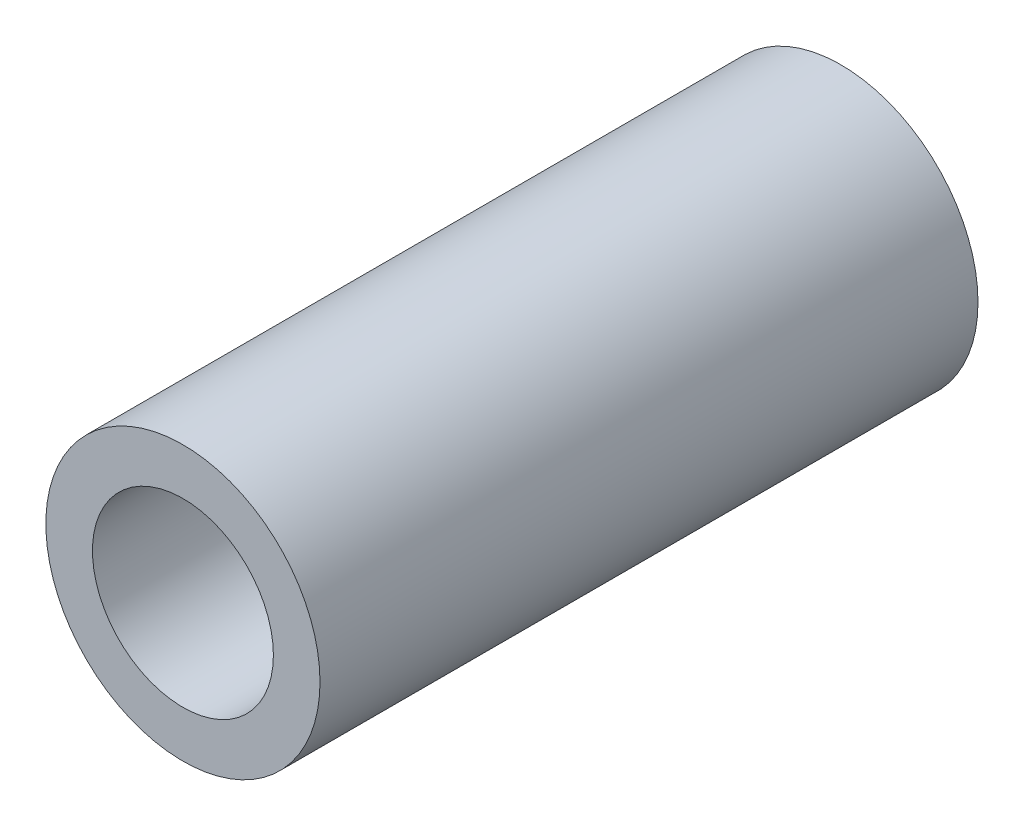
from build123d import *

# Parameters (mm, degrees)
ESQUISSE1_R        = 2.5
BOSS_EXTRU_1_DEPTH = 12
TROU_TARAUD_M41_D  = 3.3


with BuildPart() as part:
    # Esquisse1 → Boss.-Extru.1 (new body)
    with BuildSketch(Plane.XY):
        Circle(ESQUISSE1_R)
    extrude(amount=BOSS_EXTRU_1_DEPTH)

    # Trou taraud_ M41 (through all)
    with Locations(Plane.XY.offset(12)):
        with Locations((0, 0)):
            Hole(TROU_TARAUD_M41_D / 2)


solid = part.part
